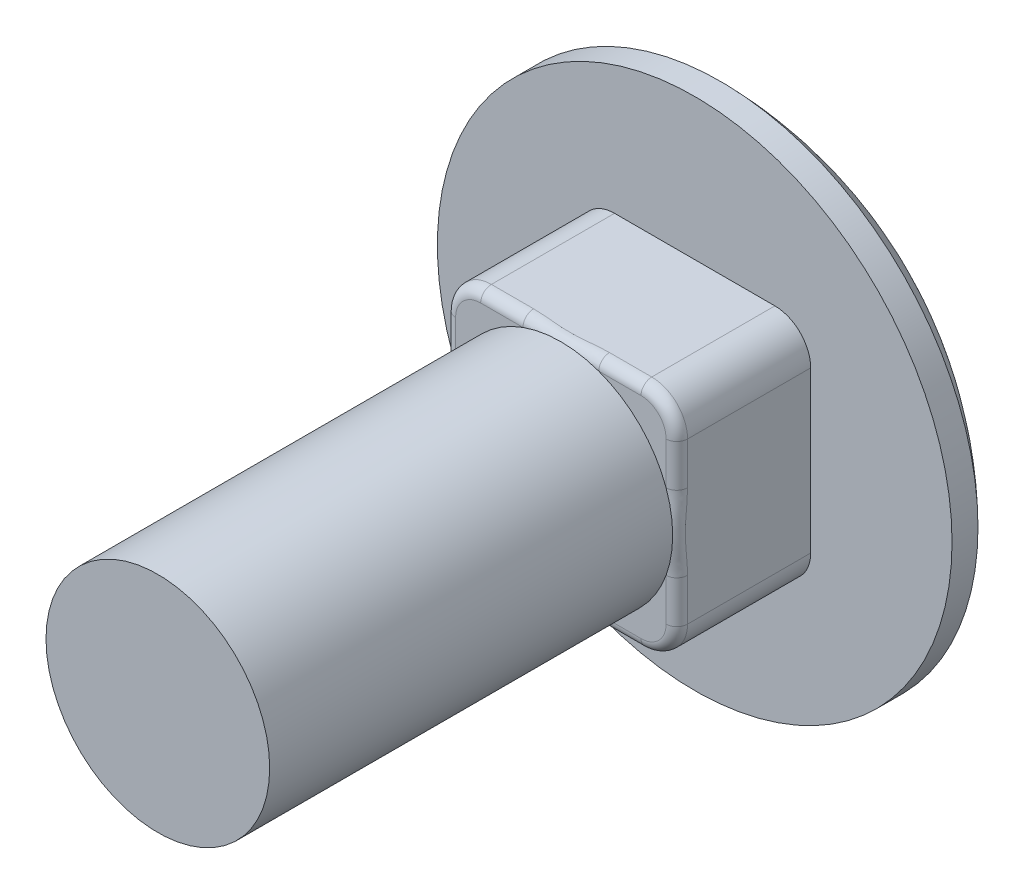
from build123d import *

# Parameters (mm, degrees)
SKETCH2_W      = 8.2296
SKETCH2_H      = 8.2296
EXTRUDE1_DEPTH = 4.7498
SKETCH3_R      = 3.96875
EXTRUDE2_DEPTH = 14.3002
FILLET1_R      = 1.27
FILLET2_R      = 0.381


with BuildPart() as part:
    # Sketch1 → Revolve1 (revolve)
    with BuildSketch(Plane(origin=(0, 0, 0), x_dir=(0, 0, -1), z_dir=(1, 0, 0)), mode=Mode.PRIVATE) as revolve1_sk:
        with BuildLine():
            Line((0, 0), (4.4704, 0))
            ThreePointArc((4.4704, 0), (3.611515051, 4.921707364), (0.92075, 9.1313))
            Line((0.92075, 9.1313), (0, 9.1313))
            Line((0, 9.1313), (0, 0))
        make_face()
    revolve(revolve1_sk.sketch.rotate(Axis((0, 0, 0), (0, 0, -1)), 90), axis=Axis((0, 0, 0), (0, 0, -1)))

    # Sketch2 → Extrude1 (add)
    with BuildSketch(Plane.XY):
        Rectangle(SKETCH2_W, SKETCH2_H)
    extrude(amount=EXTRUDE1_DEPTH)

    # Sketch3 → Extrude2 (add)
    with BuildSketch(Plane.XY.offset(4.7498)):
        Circle(SKETCH3_R)
    extrude(amount=EXTRUDE2_DEPTH)

    # Fillet1
    fillet1_edges = [part.edges().sort_by_distance(p)[0] for p in [
        (-4.1148, 4.1148, 2.3749),
        (-4.1148, -4.1148, 2.3749),
        (4.1148, -4.1148, 2.3749),
        (4.1148, 4.1148, 2.3749),
    ]]
    fillet(fillet1_edges, radius=FILLET1_R)

    # Fillet2
    fillet2_edges = [part.edges().sort_by_distance(p)[0] for p in [
        (-4.1148, 0, 4.7498),
        (0, 4.1148, 4.7498),
        (0, -4.1148, 4.7498),
        (4.1148, 0, 4.7498),
        (3.742825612, 3.742825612, 4.7498),
        (3.742825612, -3.742825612, 4.7498),
        (-3.742825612, -3.742825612, 4.7498),
        (-3.742825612, 3.742825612, 4.7498),
    ]]
    fillet(fillet2_edges, radius=FILLET2_R)


solid = part.part
